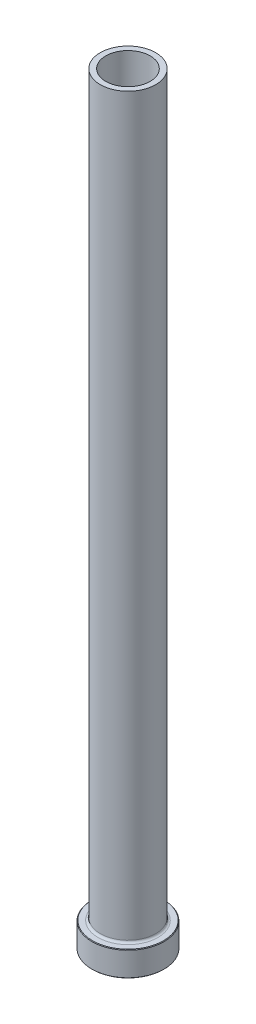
from build123d import *

# Parameters (mm, degrees)
FILLET1_R     = 0.8
CHAMFER1_SIZE = 0.2
CHAMFER3_SIZE = 0.5


with BuildPart() as part:
    # Sketch1 → Revolve1 (revolve)
    with BuildSketch(Plane.XY, mode=Mode.PRIVATE) as revolve1_sk:
        Polygon((-8, 275), (-10, 275), (-10, 9), (-13, 9), (-13, 0), (-8.25, 0), (-8.25, 208), (-8, 220), align=None)
    revolve(revolve1_sk.sketch.rotate(Axis((0, 92.187680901, 0), (0, -1, 0)), 270), axis=Axis((0, 92.187680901, 0), (0, -1, 0)))

    # Fillet1
    fillet1_edges = [part.edges().sort_by_distance(p)[0] for p in [
        (0, 9, -10),
    ]]
    fillet(fillet1_edges, radius=FILLET1_R)

    # Chamfer1
    chamfer1_edges = [part.edges().sort_by_distance(p)[0] for p in [
        (0, 0, -13),
        (0, 9, -13),
    ]]
    chamfer(chamfer1_edges, length=CHAMFER1_SIZE)

    # Chamfer3
    chamfer3_edges = [part.edges().sort_by_distance(p)[0] for p in [
        (0, 0, -8.25),
    ]]
    chamfer(chamfer3_edges, length=CHAMFER3_SIZE)


solid = part.part
